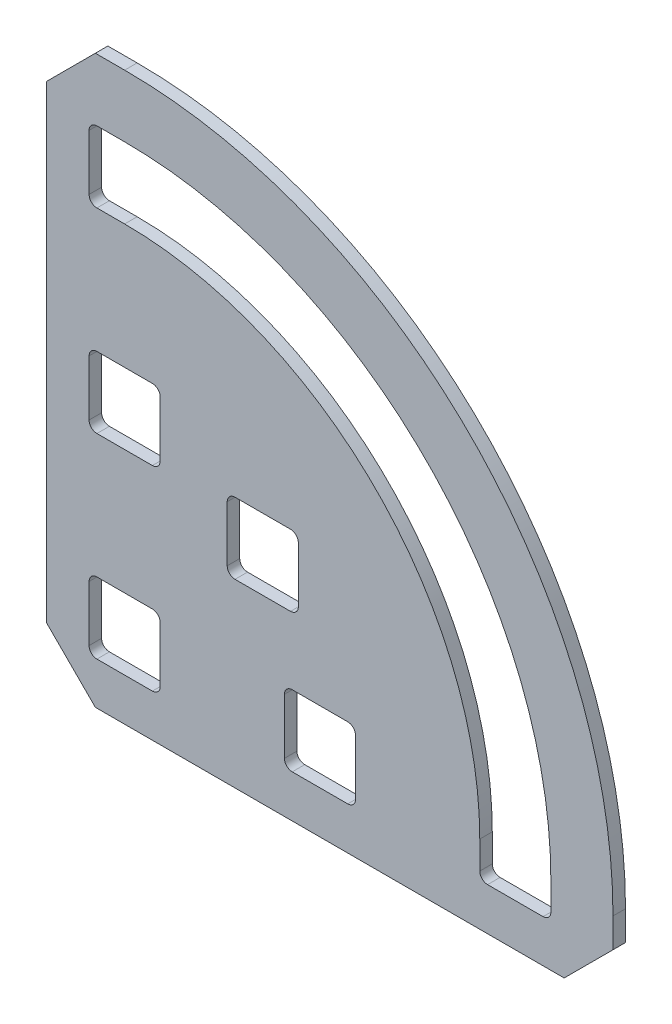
from build123d import *

# Parameters (mm, degrees)
BOSS_EXTRUDE1_DEPTH = 0.8128


with BuildPart() as part:
    # Sketch1 → Boss-Extrude1 (new body)
    with BuildSketch(Plane.XY.offset(0.8128)):
        with BuildLine():
            Line((-14.966560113, 23.146095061), (-14.966560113, -7.333904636))
            Line((-14.966560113, -7.333904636), (-11.791560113, -10.508904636))
            Line((-11.791560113, -10.508904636), (18.688439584, -10.508904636))
            Line((18.688439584, -10.508904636), (21.863439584, -7.333904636))
            Line((21.863439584, -7.333904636), (21.863439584, -5.428904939))
            ThreePointArc((21.863439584, -5.428904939), (12.564079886, 17.021735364), (-9.886560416, 26.321095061))
            Line((-9.886560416, 26.321095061), (-11.791560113, 26.321095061))
            Line((-11.791560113, 26.321095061), (-14.966560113, 23.146095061))
        make_face()
        with BuildLine():
            Line((17.316839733, -7.740304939), (13.710039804, -7.740304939))
            ThreePointArc((13.710039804, -7.740304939), (13.350829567, -7.591515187), (13.202039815, -7.23230495))
            Line((13.202039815, -7.23230495), (13.202039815, -5.428904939))
            ThreePointArc((13.202039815, -5.428904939), (6.439545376, 10.897200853), (-9.886560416, 17.659695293))
            Line((-9.886560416, 17.659695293), (-11.689960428, 17.659695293))
            ThreePointArc((-11.689960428, 17.659695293), (-12.049170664, 17.808485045), (-12.197960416, 18.167695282))
            Line((-12.197960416, 18.167695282), (-12.197960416, 21.77449521))
            ThreePointArc((-12.197960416, 21.77449521), (-12.049170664, 22.133705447), (-11.689960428, 22.282495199))
            Line((-11.689960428, 22.282495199), (-9.886560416, 22.282495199))
            ThreePointArc((-9.886560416, 22.282495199), (9.708358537, 14.166014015), (17.824839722, -5.428904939))
            Line((17.824839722, -5.428904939), (17.824839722, -7.23230495))
            ThreePointArc((17.824839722, -7.23230495), (17.67604997, -7.591515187), (17.316839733, -7.740304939))
        make_face(mode=Mode.SUBTRACT)
        with BuildLine():
            Line((5.124839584, -3.625504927), (5.124839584, -7.23230495))
            ThreePointArc((5.124839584, -7.23230495), (4.976049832, -7.591515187), (4.616839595, -7.740304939))
            Line((4.616839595, -7.740304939), (1.010039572, -7.740304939))
            ThreePointArc((1.010039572, -7.740304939), (0.650829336, -7.591515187), (0.502039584, -7.23230495))
            Line((0.502039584, -7.23230495), (0.502039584, -3.625504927))
            ThreePointArc((0.502039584, -3.625504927), (0.650829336, -3.266294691), (1.010039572, -3.117504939))
            Line((1.010039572, -3.117504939), (4.616839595, -3.117504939))
            ThreePointArc((4.616839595, -3.117504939), (4.976049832, -3.266294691), (5.124839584, -3.625504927))
        make_face(mode=Mode.SUBTRACT)
        with BuildLine():
            Line((-2.709790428, 5.862665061), (0.897009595, 5.862665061))
            ThreePointArc((0.897009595, 5.862665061), (1.256219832, 5.713875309), (1.405009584, 5.354665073))
            Line((1.405009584, 5.354665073), (1.405009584, 1.74786505))
            ThreePointArc((1.405009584, 1.74786505), (1.256219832, 1.388654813), (0.897009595, 1.239865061))
            Line((0.897009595, 1.239865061), (-2.709790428, 1.239865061))
            ThreePointArc((-2.709790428, 1.239865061), (-3.069000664, 1.388654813), (-3.217790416, 1.74786505))
            Line((-3.217790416, 1.74786505), (-3.217790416, 5.354665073))
            ThreePointArc((-3.217790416, 5.354665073), (-3.069000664, 5.713875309), (-2.709790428, 5.862665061))
        make_face(mode=Mode.SUBTRACT)
        with BuildLine():
            Line((-11.689960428, 9.582495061), (-8.083160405, 9.582495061))
            ThreePointArc((-8.083160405, 9.582495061), (-7.723950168, 9.433705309), (-7.575160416, 9.074495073))
            Line((-7.575160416, 9.074495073), (-7.575160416, 5.46769505))
            ThreePointArc((-7.575160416, 5.46769505), (-7.723950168, 5.108484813), (-8.083160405, 4.959695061))
            Line((-8.083160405, 4.959695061), (-11.689960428, 4.959695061))
            ThreePointArc((-11.689960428, 4.959695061), (-12.049170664, 5.108484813), (-12.197960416, 5.46769505))
            Line((-12.197960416, 5.46769505), (-12.197960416, 9.074495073))
            ThreePointArc((-12.197960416, 9.074495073), (-12.049170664, 9.433705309), (-11.689960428, 9.582495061))
        make_face(mode=Mode.SUBTRACT)
        with BuildLine():
            Line((-8.083160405, -7.740304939), (-11.689960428, -7.740304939))
            ThreePointArc((-11.689960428, -7.740304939), (-12.049170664, -7.591515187), (-12.197960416, -7.23230495))
            Line((-12.197960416, -7.23230495), (-12.197960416, -3.625504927))
            ThreePointArc((-12.197960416, -3.625504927), (-12.049170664, -3.266294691), (-11.689960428, -3.117504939))
            Line((-11.689960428, -3.117504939), (-8.083160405, -3.117504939))
            ThreePointArc((-8.083160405, -3.117504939), (-7.723950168, -3.266294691), (-7.575160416, -3.625504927))
            Line((-7.575160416, -3.625504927), (-7.575160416, -7.23230495))
            ThreePointArc((-7.575160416, -7.23230495), (-7.723950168, -7.591515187), (-8.083160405, -7.740304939))
        make_face(mode=Mode.SUBTRACT)
    extrude(amount=-BOSS_EXTRUDE1_DEPTH)


solid = part.part
